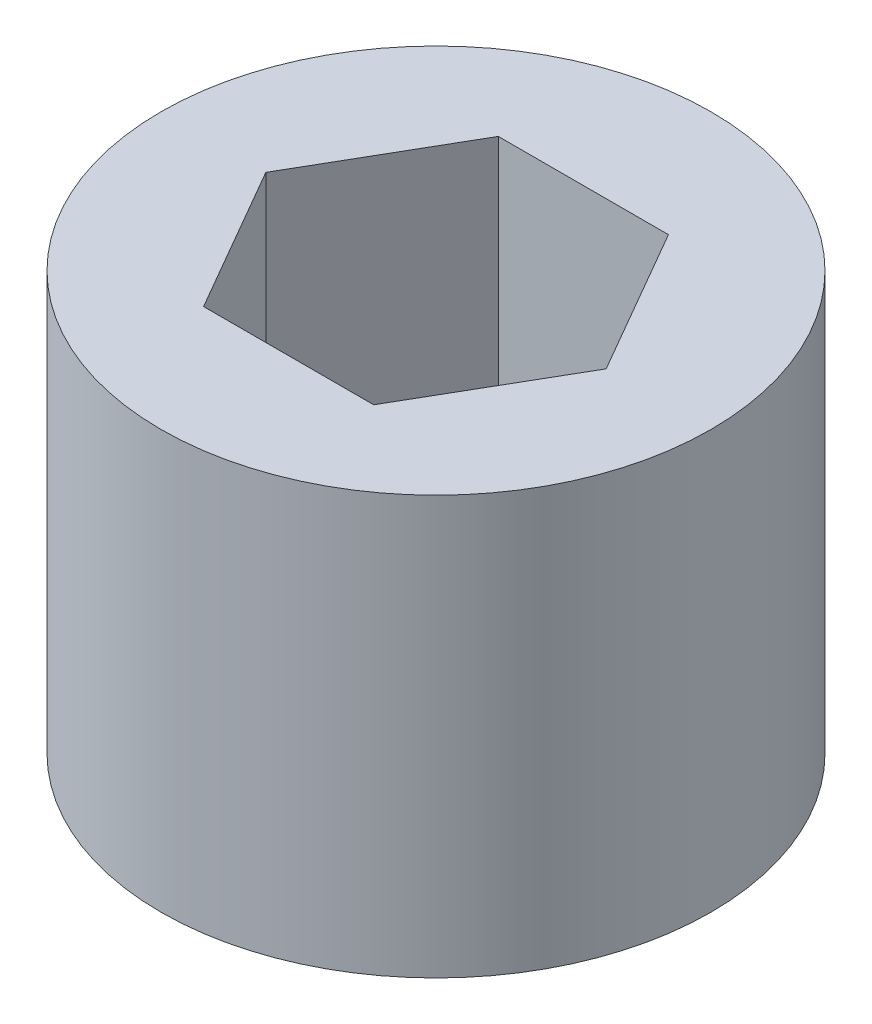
from build123d import *

# Parameters (mm, degrees)
SKETCH1_R      = 4.445
EXTRUDE1_DEPTH = 6.7564
EXTRUDE3_DEPTH = 4.7752


with BuildPart() as part:
    # Sketch1 → Extrude1 (new body)
    with BuildSketch(Plane(origin=(0, 0, 0), x_dir=(1, 0, 0), z_dir=(0, 1, 0))):
        with Locations(Location((0, 0, 0), (0, 0, 270))):
            Circle(SKETCH1_R)
    extrude(amount=EXTRUDE1_DEPTH)

    # Sketch3 → Extrude3 (cut)
    with BuildSketch(Plane(origin=(0, 6.7564, 0), x_dir=(1, 0, 0), z_dir=(0, 1, 0))):
        Polygon((1.374815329, -2.38125), (2.749630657, 0), (1.374815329, 2.38125), (-1.374815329, 2.38125), (-2.749630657, 0), (-1.374815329, -2.38125), align=None)
    extrude(amount=-EXTRUDE3_DEPTH, mode=Mode.SUBTRACT)


solid = part.part
